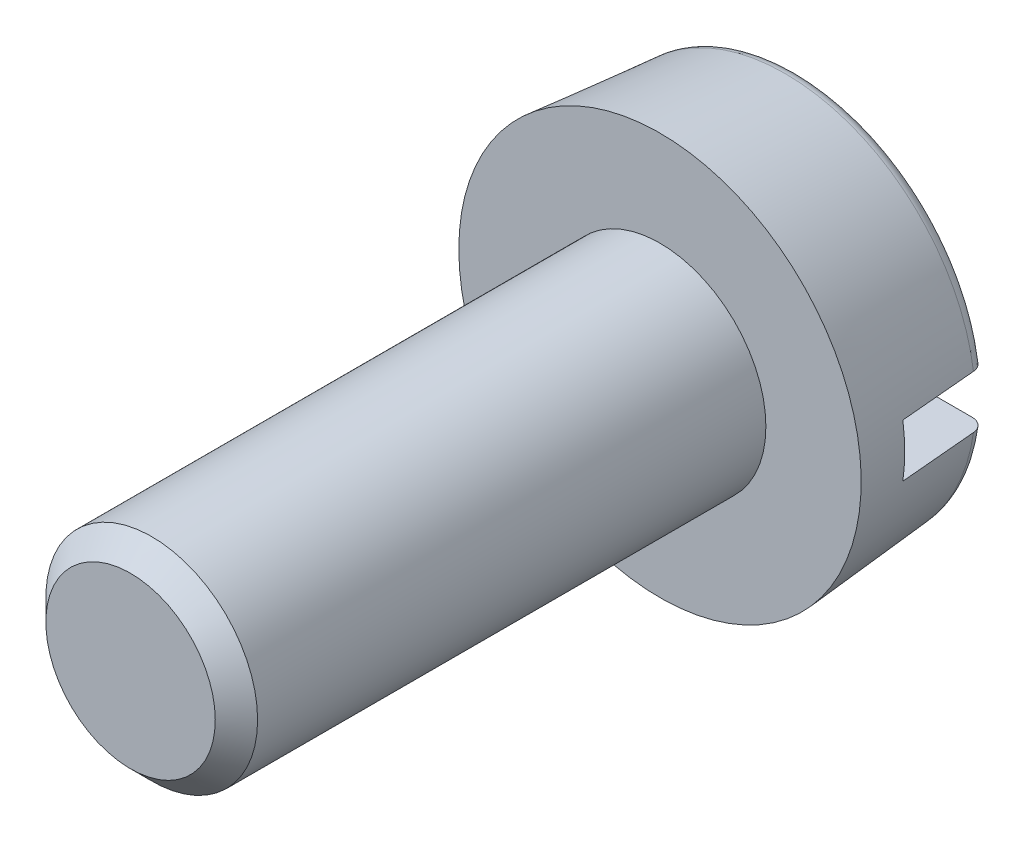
ISO-10303-21;
HEADER;
FILE_DESCRIPTION(('STEP AP214'),'2;1');
FILE_NAME('part.step','',(''),(''),'','','');
FILE_SCHEMA(('AUTOMOTIVE_DESIGN { 1 0 10303 214 1 1 1 1 }'));
ENDSEC;
DATA;
#1=APPLICATION_CONTEXT('core data for automotive mechanical design processes');
#2=APPLICATION_PROTOCOL_DEFINITION('international standard','automotive_design',2000,#1);
#3=PRODUCT_CONTEXT('',#1,'mechanical');
#4=PRODUCT('Part','Part','',(#3));
#5=PRODUCT_RELATED_PRODUCT_CATEGORY('part','',(#4));
#6=PRODUCT_DEFINITION_FORMATION('','',#4);
#7=PRODUCT_DEFINITION_CONTEXT('part definition',#1,'design');
#8=PRODUCT_DEFINITION('design','',#6,#7);
#9=PRODUCT_DEFINITION_SHAPE('','',#8);
#10=(LENGTH_UNIT() NAMED_UNIT(*) SI_UNIT(.MILLI.,.METRE.));
#11=(NAMED_UNIT(*) PLANE_ANGLE_UNIT() SI_UNIT($,.RADIAN.));
#12=(NAMED_UNIT(*) SI_UNIT($,.STERADIAN.) SOLID_ANGLE_UNIT());
#13=UNCERTAINTY_MEASURE_WITH_UNIT(LENGTH_MEASURE(1.E-05),#10,'distance_accuracy_value','');
#14=(GEOMETRIC_REPRESENTATION_CONTEXT(3) GLOBAL_UNCERTAINTY_ASSIGNED_CONTEXT((#13)) GLOBAL_UNIT_ASSIGNED_CONTEXT((#10,
#11,#12)) REPRESENTATION_CONTEXT('',''));
#15=CARTESIAN_POINT('',(0.,0.,0.));
#16=DIRECTION('',(0.,0.,1.));
#17=DIRECTION('',(1.,0.,0.));
#18=AXIS2_PLACEMENT_3D('',#15,#16,#17);
#19=CARTESIAN_POINT('',(0.,0.,-1.3));
#20=DIRECTION('',(0.,0.,1.));
#21=DIRECTION('',(1.,0.,0.));
#22=AXIS2_PLACEMENT_3D('',#19,#20,#21);
#23=PLANE('',#22);
#24=DIRECTION('',(1.,0.,0.));
#25=VECTOR('',#24,1.);
#26=CARTESIAN_POINT('',(-1.9,-0.25,-1.3));
#27=LINE('',#26,#25);
#28=CARTESIAN_POINT('',(-1.64829044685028,-0.25,-1.3));
#29=VERTEX_POINT('',#28);
#30=CARTESIAN_POINT('',(1.64829044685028,-0.25,-1.3));
#31=VERTEX_POINT('',#30);
#32=EDGE_CURVE('E176',#29,#31,#27,.T.);
#33=ORIENTED_EDGE('',*,*,#32,.T.);
#34=CARTESIAN_POINT('',(0.,0.,-1.3));
#35=DIRECTION('',(0.,0.,-1.));
#36=DIRECTION('',(-1.,0.,0.));
#37=AXIS2_PLACEMENT_3D('',#34,#35,#36);
#38=CIRCLE('',#37,1.66714168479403);
#39=EDGE_CURVE('E109',#31,#29,#38,.T.);
#40=ORIENTED_EDGE('',*,*,#39,.T.);
#41=EDGE_LOOP('',(#33,#40));
#42=FACE_BOUND('',#41,.T.);
#43=ADVANCED_FACE('F29',(#42),#23,.F.);
#44=DIRECTION('',(-1.,0.,0.));
#45=VECTOR('',#44,1.);
#46=CARTESIAN_POINT('',(-1.9,0.25,-1.3));
#47=LINE('',#46,#45);
#48=CARTESIAN_POINT('',(1.64829044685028,0.25,-1.3));
#49=VERTEX_POINT('',#48);
#50=CARTESIAN_POINT('',(-1.64829044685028,0.25,-1.3));
#51=VERTEX_POINT('',#50);
#52=EDGE_CURVE('E94',#49,#51,#47,.T.);
#53=ORIENTED_EDGE('',*,*,#52,.T.);
#54=EDGE_CURVE('E106',#51,#49,#38,.T.);
#55=ORIENTED_EDGE('',*,*,#54,.T.);
#56=EDGE_LOOP('',(#53,#55));
#57=FACE_BOUND('',#56,.T.);
#58=ADVANCED_FACE('F170',(#57),#23,.F.);
#59=CARTESIAN_POINT('',(0.,0.,-1.17));
#60=DIRECTION('',(0.,0.,-1.));
#61=DIRECTION('',(-1.,0.,0.));
#62=AXIS2_PLACEMENT_3D('',#59,#60,#61);
#63=TOROIDAL_SURFACE('',#62,1.66714168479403,0.13);
#64=CARTESIAN_POINT('',(-1.75207940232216,-0.25,-1.24972476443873));
#65=CARTESIAN_POINT('',(-1.75656295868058,-0.25,-1.24400743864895));
#66=CARTESIAN_POINT('',(-1.76056962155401,-0.25,-1.23790979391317));
#67=CARTESIAN_POINT('',(-1.76750704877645,-0.25,-1.22512420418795));
#68=CARTESIAN_POINT('',(-1.77043663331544,-0.25,-1.21843562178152));
#69=CARTESIAN_POINT('',(-1.77512829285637,-0.25,-1.20466142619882));
#70=CARTESIAN_POINT('',(-1.77689059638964,-0.25,-1.19757589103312));
#71=CARTESIAN_POINT('',(-1.77919471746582,-0.25,-1.18321083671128));
#72=CARTESIAN_POINT('',(-1.77973682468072,-0.25,-1.17593136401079));
#73=CARTESIAN_POINT('',(-1.77958551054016,-0.25,-1.16141340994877));
#74=CARTESIAN_POINT('',(-1.77889684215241,-0.25,-1.15417487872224));
#75=CARTESIAN_POINT('',(-1.7763137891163,-0.25,-1.13991614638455));
#76=CARTESIAN_POINT('',(-1.77441937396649,-0.25,-1.13289595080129));
#77=CARTESIAN_POINT('',(-1.76948140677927,-0.25,-1.11927276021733));
#78=CARTESIAN_POINT('',(-1.76643792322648,-0.25,-1.11266974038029));
#79=CARTESIAN_POINT('',(-1.75929153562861,-0.25,-1.10006454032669));
#80=CARTESIAN_POINT('',(-1.75518861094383,-0.25,-1.0940623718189));
#81=CARTESIAN_POINT('',(-1.74601676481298,-0.25,-1.08279196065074));
#82=CARTESIAN_POINT('',(-1.740942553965,-0.25,-1.07752802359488));
#83=CARTESIAN_POINT('',(-1.72998967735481,-0.25,-1.06791716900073));
#84=CARTESIAN_POINT('',(-1.72411097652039,-0.25,-1.06357029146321));
#85=CARTESIAN_POINT('',(-1.71165749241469,-0.25,-1.05587313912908));
#86=CARTESIAN_POINT('',(-1.70507670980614,-0.25,-1.05253257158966));
#87=CARTESIAN_POINT('',(-1.69145156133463,-0.25,-1.04699146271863));
#88=CARTESIAN_POINT('',(-1.68440716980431,-0.25,-1.04479098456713));
#89=CARTESIAN_POINT('',(-1.66998114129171,-0.25,-1.04157111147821));
#90=CARTESIAN_POINT('',(-1.6625968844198,-0.25,-1.04056344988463));
#91=CARTESIAN_POINT('',(-1.64776364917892,-0.25,-1.03979376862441));
#92=CARTESIAN_POINT('',(-1.64031466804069,-0.25,-1.04003180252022));
#93=CARTESIAN_POINT('',(-1.6255148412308,-0.25,-1.04175159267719));
#94=CARTESIAN_POINT('',(-1.61816488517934,-0.25,-1.04324101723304));
#95=CARTESIAN_POINT('',(-1.60381935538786,-0.25,-1.04743328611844));
#96=CARTESIAN_POINT('',(-1.59682378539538,-0.25,-1.05013614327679));
#97=CARTESIAN_POINT('',(-1.58339232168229,-0.25,-1.05668021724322));
#98=CARTESIAN_POINT('',(-1.57695606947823,-0.25,-1.06052069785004));
#99=CARTESIAN_POINT('',(-1.56482648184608,-0.25,-1.06923601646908));
#100=CARTESIAN_POINT('',(-1.55913311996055,-0.25,-1.07411081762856));
#101=CARTESIAN_POINT('',(-1.54870239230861,-0.25,-1.08471588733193));
#102=CARTESIAN_POINT('',(-1.54395763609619,-0.25,-1.09043888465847));
#103=CARTESIAN_POINT('',(-1.53551066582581,-0.25,-1.10260865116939));
#104=CARTESIAN_POINT('',(-1.53180837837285,-0.25,-1.10905536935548));
#105=CARTESIAN_POINT('',(-1.52560019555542,-0.25,-1.12240386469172));
#106=CARTESIAN_POINT('',(-1.52308002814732,-0.25,-1.12929900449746));
#107=CARTESIAN_POINT('',(-1.51924700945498,-0.25,-1.14341701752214));
#108=CARTESIAN_POINT('',(-1.51793407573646,-0.25,-1.15063986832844));
#109=CARTESIAN_POINT('',(-1.51656397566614,-0.25,-1.16512673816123));
#110=CARTESIAN_POINT('',(-1.51649373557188,-0.25,-1.17238952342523));
#111=CARTESIAN_POINT('',(-1.51757766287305,-0.25,-1.18682296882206));
#112=CARTESIAN_POINT('',(-1.51873179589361,-0.25,-1.19399363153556));
#113=CARTESIAN_POINT('',(-1.52222350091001,-0.25,-1.20801782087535));
#114=CARTESIAN_POINT('',(-1.52455754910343,-0.25,-1.21487222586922));
#115=CARTESIAN_POINT('',(-1.5303364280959,-0.25,-1.2280953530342));
#116=CARTESIAN_POINT('',(-1.53378128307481,-0.25,-1.23446406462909));
#117=CARTESIAN_POINT('',(-1.5417039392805,-0.25,-1.24657863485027));
#118=CARTESIAN_POINT('',(-1.54618795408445,-0.25,-1.25232042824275));
#119=CARTESIAN_POINT('',(-1.55604596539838,-0.25,-1.26298083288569));
#120=CARTESIAN_POINT('',(-1.56142001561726,-0.25,-1.26789939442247));
#121=CARTESIAN_POINT('',(-1.57297328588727,-0.25,-1.2768360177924));
#122=CARTESIAN_POINT('',(-1.57916128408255,-0.25,-1.28084273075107));
#123=CARTESIAN_POINT('',(-1.59211613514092,-0.25,-1.28777426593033));
#124=CARTESIAN_POINT('',(-1.5988830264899,-0.25,-1.29069901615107));
#125=CARTESIAN_POINT('',(-1.61288741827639,-0.25,-1.29541703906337));
#126=CARTESIAN_POINT('',(-1.62012943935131,-0.25,-1.29719689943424));
#127=CARTESIAN_POINT('',(-1.63480874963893,-0.25,-1.2995235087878));
#128=CARTESIAN_POINT('',(-1.64224603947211,-0.25,-1.30007025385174));
#129=CARTESIAN_POINT('',(-1.65715108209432,-0.25,-1.29991483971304));
#130=CARTESIAN_POINT('',(-1.66461876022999,-0.25,-1.29920539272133));
#131=CARTESIAN_POINT('',(-1.67933066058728,-0.25,-1.29654053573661));
#132=CARTESIAN_POINT('',(-1.68657482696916,-0.25,-1.29458481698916));
#133=CARTESIAN_POINT('',(-1.70062058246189,-0.25,-1.28948242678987));
#134=CARTESIAN_POINT('',(-1.7074226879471,-0.25,-1.28633717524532));
#135=CARTESIAN_POINT('',(-1.72039030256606,-0.25,-1.27894242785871));
#136=CARTESIAN_POINT('',(-1.72655658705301,-0.25,-1.2746942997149));
#137=CARTESIAN_POINT('',(-1.73596161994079,-0.25,-1.26695454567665));
#138=CARTESIAN_POINT('',(-1.73944542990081,-0.25,-1.26375570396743));
#139=CARTESIAN_POINT('',(-1.74604651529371,-0.25,-1.25699977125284));
#140=CARTESIAN_POINT('',(-1.74916379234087,-0.25,-1.25344268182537));
#141=CARTESIAN_POINT('',(-1.75207940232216,-0.25,-1.24972476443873));
#142=B_SPLINE_CURVE_WITH_KNOTS('',3,(#64,#65,#66,#67,#68,#69,#70,#71,#72,#73,#74,#75,#76,#77,
#78,#79,#80,#81,#82,#83,#84,#85,#86,#87,#88,#89,#90,#91,#92,#93,#94,#95,#96,#97,#98,#99,#100,
#101,#102,#103,#104,#105,#106,#107,#108,#109,#110,#111,#112,#113,#114,#115,#116,#117,#118,#119,
#120,#121,#122,#123,#124,#125,#126,#127,#128,#129,#130,#131,#132,#133,#134,#135,#136,#137,#138,
#139,#140,#141),.UNSPECIFIED.,.T.,.F.,(4,2,2,2,2,2,2,2,2,2,2,2,2,2,2,2,2,2,2,2,2,2,2,2,2,2,2,2,
2,2,2,2,2,2,2,2,2,2,4),(0.,0.0217799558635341,0.0435836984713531,0.0653831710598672,
0.0871774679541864,0.108887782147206,0.130598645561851,0.15230821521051,0.174018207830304,
0.195849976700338,0.217682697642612,0.239719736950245,0.26175799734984,0.284011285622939,
0.306265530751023,0.328657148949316,0.351049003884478,0.373426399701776,0.395802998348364,
0.417997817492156,0.440191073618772,0.462109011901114,0.484025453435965,0.505711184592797,
0.527396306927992,0.549017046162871,0.570638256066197,0.592392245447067,0.614147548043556,
0.636160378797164,0.658174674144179,0.680442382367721,0.70271016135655,0.725107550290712,
0.747510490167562,0.769886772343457,0.792235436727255,0.806398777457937,0.820562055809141),.UNSPECIFIED.);
#143=CARTESIAN_POINT('',(-1.77916846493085,-0.25,-1.1813302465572));
#144=VERTEX_POINT('',#143);
#145=EDGE_CURVE('E51',#29,#144,#142,.T.);
#146=ORIENTED_EDGE('',*,*,#145,.F.);
#147=ORIENTED_EDGE('',*,*,#39,.F.);
#148=CARTESIAN_POINT('',(1.53241969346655,-0.25,-1.23162912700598));
#149=CARTESIAN_POINT('',(1.52895812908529,-0.25,-1.22528322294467));
#150=CARTESIAN_POINT('',(1.52602672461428,-0.25,-1.21864252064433));
#151=CARTESIAN_POINT('',(1.52131693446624,-0.25,-1.20495835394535));
#152=CARTESIAN_POINT('',(1.51953978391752,-0.25,-1.19791446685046));
#153=CARTESIAN_POINT('',(1.51719662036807,-0.25,-1.18362880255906));
#154=CARTESIAN_POINT('',(1.51663035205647,-0.25,-1.17638706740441));
#155=CARTESIAN_POINT('',(1.51672626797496,-0.25,-1.16191354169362));
#156=CARTESIAN_POINT('',(1.51738817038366,-0.25,-1.15468174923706));
#157=CARTESIAN_POINT('',(1.51991534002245,-0.25,-1.14045434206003));
#158=CARTESIAN_POINT('',(1.52177696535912,-0.25,-1.13345807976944));
#159=CARTESIAN_POINT('',(1.52664338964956,-0.25,-1.1198751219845));
#160=CARTESIAN_POINT('',(1.52964824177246,-0.25,-1.11328844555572));
#161=CARTESIAN_POINT('',(1.53672679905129,-0.25,-1.10067887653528));
#162=CARTESIAN_POINT('',(1.54080516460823,-0.25,-1.09465860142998));
#163=CARTESIAN_POINT('',(1.54990432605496,-0.25,-1.08337850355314));
#164=CARTESIAN_POINT('',(1.554925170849,-0.25,-1.0781187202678));
#165=CARTESIAN_POINT('',(1.56582590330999,-0.25,-1.06844569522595));
#166=CARTESIAN_POINT('',(1.57171473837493,-0.25,-1.06404253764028));
#167=CARTESIAN_POINT('',(1.58414080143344,-0.25,-1.05627339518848));
#168=CARTESIAN_POINT('',(1.59067807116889,-0.25,-1.05290747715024));
#169=CARTESIAN_POINT('',(1.60430028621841,-0.25,-1.04726700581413));
#170=CARTESIAN_POINT('',(1.6113908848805,-0.25,-1.04500610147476));
#171=CARTESIAN_POINT('',(1.625849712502,-0.25,-1.04169697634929));
#172=CARTESIAN_POINT('',(1.63321795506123,-0.25,-1.04064881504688));
#173=CARTESIAN_POINT('',(1.64808070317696,-0.25,-1.03979053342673));
#174=CARTESIAN_POINT('',(1.65557573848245,-0.25,-1.03998955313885));
#175=CARTESIAN_POINT('',(1.67042618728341,-0.25,-1.04164307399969));
#176=CARTESIAN_POINT('',(1.67778159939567,-0.25,-1.04309758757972));
#177=CARTESIAN_POINT('',(1.6921417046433,-0.25,-1.04722406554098));
#178=CARTESIAN_POINT('',(1.69914644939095,-0.25,-1.04989585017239));
#179=CARTESIAN_POINT('',(1.7126035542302,-0.25,-1.05638531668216));
#180=CARTESIAN_POINT('',(1.71905593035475,-0.25,-1.06020296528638));
#181=CARTESIAN_POINT('',(1.73117715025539,-0.25,-1.0688497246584));
#182=CARTESIAN_POINT('',(1.73685100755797,-0.25,-1.07367180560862));
#183=CARTESIAN_POINT('',(1.74729844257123,-0.25,-1.08420877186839));
#184=CARTESIAN_POINT('',(1.752072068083,-0.25,-1.08992360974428));
#185=CARTESIAN_POINT('',(1.7605326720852,-0.25,-1.10202267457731));
#186=CARTESIAN_POINT('',(1.76423003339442,-0.25,-1.10839964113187));
#187=CARTESIAN_POINT('',(1.77049031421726,-0.25,-1.12168804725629));
#188=CARTESIAN_POINT('',(1.77305329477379,-0.25,-1.12859945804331));
#189=CARTESIAN_POINT('',(1.77694917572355,-0.25,-1.14269308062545));
#190=CARTESIAN_POINT('',(1.77829301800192,-0.25,-1.14987226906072));
#191=CARTESIAN_POINT('',(1.77974984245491,-0.25,-1.16435438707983));
#192=CARTESIAN_POINT('',(1.77986286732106,-0.25,-1.171657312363));
#193=CARTESIAN_POINT('',(1.77885718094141,-0.25,-1.1861421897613));
#194=CARTESIAN_POINT('',(1.77774441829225,-0.25,-1.19332455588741));
#195=CARTESIAN_POINT('',(1.77432995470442,-0.25,-1.20740073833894));
#196=CARTESIAN_POINT('',(1.772028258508,-0.25,-1.21429455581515));
#197=CARTESIAN_POINT('',(1.76630135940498,-0.25,-1.22760648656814));
#198=CARTESIAN_POINT('',(1.76287503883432,-0.25,-1.2340241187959));
#199=CARTESIAN_POINT('',(1.75500016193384,-0.25,-1.24619791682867));
#200=CARTESIAN_POINT('',(1.75055157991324,-0.25,-1.25195406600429));
#201=CARTESIAN_POINT('',(1.74072913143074,-0.25,-1.26268237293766));
#202=CARTESIAN_POINT('',(1.73534948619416,-0.25,-1.26764923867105));
#203=CARTESIAN_POINT('',(1.72383961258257,-0.25,-1.2766197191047));
#204=CARTESIAN_POINT('',(1.71770934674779,-0.25,-1.28062328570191));
#205=CARTESIAN_POINT('',(1.7048088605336,-0.25,-1.28759504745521));
#206=CARTESIAN_POINT('',(1.69803301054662,-0.25,-1.29055282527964));
#207=CARTESIAN_POINT('',(1.684083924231,-0.25,-1.29530087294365));
#208=CARTESIAN_POINT('',(1.67691066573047,-0.25,-1.29709107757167));
#209=CARTESIAN_POINT('',(1.66229791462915,-0.25,-1.29946931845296));
#210=CARTESIAN_POINT('',(1.65485654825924,-0.25,-1.30004584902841));
#211=CARTESIAN_POINT('',(1.63998216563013,-0.25,-1.29994844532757));
#212=CARTESIAN_POINT('',(1.63254914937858,-0.25,-1.29927450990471));
#213=CARTESIAN_POINT('',(1.61786269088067,-0.25,-1.29668841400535));
#214=CARTESIAN_POINT('',(1.61061034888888,-0.25,-1.29476999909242));
#215=CARTESIAN_POINT('',(1.59652954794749,-0.25,-1.28973991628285));
#216=CARTESIAN_POINT('',(1.58970119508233,-0.25,-1.28662795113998));
#217=CARTESIAN_POINT('',(1.57667829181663,-0.25,-1.27930148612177));
#218=CARTESIAN_POINT('',(1.57048279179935,-0.25,-1.27508867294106));
#219=CARTESIAN_POINT('',(1.55890129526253,-0.25,-1.2656764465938));
#220=CARTESIAN_POINT('',(1.55351430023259,-0.25,-1.26047826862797));
#221=CARTESIAN_POINT('',(1.54550147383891,-0.25,-1.25129950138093));
#222=CARTESIAN_POINT('',(1.54258582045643,-0.25,-1.24756772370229));
#223=CARTESIAN_POINT('',(1.5371776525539,-0.25,-1.23980909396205));
#224=CARTESIAN_POINT('',(1.53468513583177,-0.25,-1.23578224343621));
#225=CARTESIAN_POINT('',(1.53241969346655,-0.25,-1.23162912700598));
#226=B_SPLINE_CURVE_WITH_KNOTS('',3,(#148,#149,#150,#151,#152,#153,#154,#155,#156,#157,#158,
#159,#160,#161,#162,#163,#164,#165,#166,#167,#168,#169,#170,#171,#172,#173,#174,#175,#176,#177,
#178,#179,#180,#181,#182,#183,#184,#185,#186,#187,#188,#189,#190,#191,#192,#193,#194,#195,#196,
#197,#198,#199,#200,#201,#202,#203,#204,#205,#206,#207,#208,#209,#210,#211,#212,#213,#214,#215,
#216,#217,#218,#219,#220,#221,#222,#223,#224,#225),.UNSPECIFIED.,.T.,.F.,(4,2,2,2,2,2,2,2,2,2,2,
2,2,2,2,2,2,2,2,2,2,2,2,2,2,2,2,2,2,2,2,2,2,2,2,2,2,2,4),(0.,0.0216687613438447,
0.0433606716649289,0.0650480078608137,0.0867303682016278,0.10834721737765,0.129965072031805,
0.151678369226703,0.173392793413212,0.195349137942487,0.217306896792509,0.239529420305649,
0.261753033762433,0.284139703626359,0.30652659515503,0.32891018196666,0.351293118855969,
0.373524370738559,0.395754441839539,0.417762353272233,0.439769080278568,0.461576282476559,
0.483382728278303,0.505083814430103,0.526784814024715,0.548507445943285,0.570230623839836,
0.592093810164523,0.613958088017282,0.636034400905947,0.658111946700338,0.680397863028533,
0.702683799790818,0.725082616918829,0.747487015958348,0.769857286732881,0.79219969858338,
0.806381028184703,0.820562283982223),.UNSPECIFIED.);
#227=CARTESIAN_POINT('',(1.77916846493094,-0.25,-1.18133024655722));
#228=VERTEX_POINT('',#227);
#229=EDGE_CURVE('E126',#228,#31,#226,.T.);
#230=ORIENTED_EDGE('',*,*,#229,.F.);
#231=CARTESIAN_POINT('',(0.,0.,-1.1813302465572));
#232=DIRECTION('',(0.,0.,-1.));
#233=DIRECTION('',(-1.,0.,0.));
#234=AXIS2_PLACEMENT_3D('',#231,#232,#233);
#235=CIRCLE('',#234,1.79664699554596);
#236=EDGE_CURVE('E118',#228,#144,#235,.T.);
#237=ORIENTED_EDGE('',*,*,#236,.T.);
#238=EDGE_LOOP('',(#146,#147,#230,#237));
#239=FACE_BOUND('',#238,.T.);
#240=ADVANCED_FACE('F130',(#239),#63,.T.);
#241=CARTESIAN_POINT('',(-1.75207940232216,0.25,-1.24972476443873));
#242=CARTESIAN_POINT('',(-1.74753384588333,0.25,-1.25552008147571));
#243=CARTESIAN_POINT('',(-1.74249152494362,0.25,-1.26093301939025));
#244=CARTESIAN_POINT('',(-1.73156319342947,0.25,-1.27083741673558));
#245=CARTESIAN_POINT('',(-1.72567607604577,0.25,-1.27532764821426));
#246=CARTESIAN_POINT('',(-1.71323808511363,0.25,-1.28325494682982));
#247=CARTESIAN_POINT('',(-1.70668781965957,0.25,-1.28669296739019));
#248=CARTESIAN_POINT('',(-1.69310817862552,0.25,-1.29242853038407));
#249=CARTESIAN_POINT('',(-1.68607892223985,0.25,-1.29472635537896));
#250=CARTESIAN_POINT('',(-1.67168398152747,0.25,-1.29813613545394));
#251=CARTESIAN_POINT('',(-1.66431621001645,0.25,-1.29923928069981));
#252=CARTESIAN_POINT('',(-1.64949946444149,0.25,-1.30020167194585));
#253=CARTESIAN_POINT('',(-1.64205048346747,0.25,-1.3000608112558));
#254=CARTESIAN_POINT('',(-1.62723283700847,0.25,-1.29853489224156));
#255=CARTESIAN_POINT('',(-1.61986498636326,0.25,-1.29714190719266));
#256=CARTESIAN_POINT('',(-1.60546759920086,0.25,-1.29313852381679));
#257=CARTESIAN_POINT('',(-1.59843806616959,0.25,-1.2905281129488));
#258=CARTESIAN_POINT('',(-1.58492127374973,0.25,-1.28416137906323));
#259=CARTESIAN_POINT('',(-1.57843382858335,0.25,-1.28040545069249));
#260=CARTESIAN_POINT('',(-1.56618806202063,0.25,-1.27184963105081));
#261=CARTESIAN_POINT('',(-1.56042971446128,0.25,-1.267049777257));
#262=CARTESIAN_POINT('',(-1.54985607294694,0.25,-1.25658080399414));
#263=CARTESIAN_POINT('',(-1.54503371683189,0.25,-1.25091881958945));
#264=CARTESIAN_POINT('',(-1.53642220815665,0.25,-1.23885702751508));
#265=CARTESIAN_POINT('',(-1.53263298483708,0.25,-1.23245727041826));
#266=CARTESIAN_POINT('',(-1.52624509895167,0.25,-1.21918622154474));
#267=CARTESIAN_POINT('',(-1.52363231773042,0.25,-1.21232172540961));
#268=CARTESIAN_POINT('',(-1.51961046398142,0.25,-1.19824877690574));
#269=CARTESIAN_POINT('',(-1.51820130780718,0.25,-1.19104034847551));
#270=CARTESIAN_POINT('',(-1.51663936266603,0.25,-1.17656707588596));
#271=CARTESIAN_POINT('',(-1.51647326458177,0.25,-1.16930366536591));
#272=CARTESIAN_POINT('',(-1.51736741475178,0.25,-1.15485289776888));
#273=CARTESIAN_POINT('',(-1.51842762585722,0.25,-1.14766553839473));
#274=CARTESIAN_POINT('',(-1.52173595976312,0.25,-1.13359521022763));
#275=CARTESIAN_POINT('',(-1.52398011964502,0.25,-1.1267113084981));
#276=CARTESIAN_POINT('',(-1.52958577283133,0.25,-1.11341479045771));
#277=CARTESIAN_POINT('',(-1.53294728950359,0.25,-1.10700218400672));
#278=CARTESIAN_POINT('',(-1.54071039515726,0.25,-1.09478854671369));
#279=CARTESIAN_POINT('',(-1.54511792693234,0.25,-1.08899129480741));
#280=CARTESIAN_POINT('',(-1.55483332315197,0.25,-1.07820818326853));
#281=CARTESIAN_POINT('',(-1.56014123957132,0.25,-1.07322237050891));
#282=CARTESIAN_POINT('',(-1.57157292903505,0.25,-1.064141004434));
#283=CARTESIAN_POINT('',(-1.57770553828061,0.25,-1.06005657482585));
#284=CARTESIAN_POINT('',(-1.59056318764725,0.25,-1.05296136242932));
#285=CARTESIAN_POINT('',(-1.59728826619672,0.25,-1.04995064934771));
#286=CARTESIAN_POINT('',(-1.61122407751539,0.25,-1.04505337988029));
#287=CARTESIAN_POINT('',(-1.61843954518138,0.25,-1.04318029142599));
#288=CARTESIAN_POINT('',(-1.63308191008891,0.25,-1.04066365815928));
#289=CARTESIAN_POINT('',(-1.64050881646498,0.25,-1.04002016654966));
#290=CARTESIAN_POINT('',(-1.6554122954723,0.25,-1.03998064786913));
#291=CARTESIAN_POINT('',(-1.66288889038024,0.25,-1.04059238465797));
#292=CARTESIAN_POINT('',(-1.6776330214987,0.25,-1.04306400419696));
#293=CARTESIAN_POINT('',(-1.68490055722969,0.25,-1.0449238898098));
#294=CARTESIAN_POINT('',(-1.69900829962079,0.25,-1.04983951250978));
#295=CARTESIAN_POINT('',(-1.7058490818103,0.25,-1.05289359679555));
#296=CARTESIAN_POINT('',(-1.71891537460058,0.25,-1.0601153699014));
#297=CARTESIAN_POINT('',(-1.72514090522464,0.25,-1.06428302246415));
#298=CARTESIAN_POINT('',(-1.73674840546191,0.25,-1.07358109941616));
#299=CARTESIAN_POINT('',(-1.74213641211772,0.25,-1.07870398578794));
#300=CARTESIAN_POINT('',(-1.75196509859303,0.25,-1.08978982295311));
#301=CARTESIAN_POINT('',(-1.7564058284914,0.25,-1.09575272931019));
#302=CARTESIAN_POINT('',(-1.76416637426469,0.25,-1.10828464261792));
#303=CARTESIAN_POINT('',(-1.76749705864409,0.25,-1.11484691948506));
#304=CARTESIAN_POINT('',(-1.77299835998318,0.25,-1.12844064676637));
#305=CARTESIAN_POINT('',(-1.77516908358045,0.25,-1.13547205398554));
#306=CARTESIAN_POINT('',(-1.77827125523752,0.25,-1.1497390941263));
#307=CARTESIAN_POINT('',(-1.77921328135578,0.25,-1.1569724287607));
#308=CARTESIAN_POINT('',(-1.77986439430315,0.25,-1.17149630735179));
#309=CARTESIAN_POINT('',(-1.77957320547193,0.25,-1.17878686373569));
#310=CARTESIAN_POINT('',(-1.77776969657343,0.25,-1.19318884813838));
#311=CARTESIAN_POINT('',(-1.77626159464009,0.25,-1.20030080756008));
#312=CARTESIAN_POINT('',(-1.77207528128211,0.25,-1.21416491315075));
#313=CARTESIAN_POINT('',(-1.76939850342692,0.25,-1.22091748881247));
#314=CARTESIAN_POINT('',(-1.76421733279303,0.25,-1.23134452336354));
#315=CARTESIAN_POINT('',(-1.7620532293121,0.25,-1.23519194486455));
#316=CARTESIAN_POINT('',(-1.75734526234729,0.25,-1.24264687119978));
#317=CARTESIAN_POINT('',(-1.75480140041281,0.25,-1.24625437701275));
#318=CARTESIAN_POINT('',(-1.75207940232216,0.25,-1.24972476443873));
#319=B_SPLINE_CURVE_WITH_KNOTS('',3,(#241,#242,#243,#244,#245,#246,#247,#248,#249,#250,#251,
#252,#253,#254,#255,#256,#257,#258,#259,#260,#261,#262,#263,#264,#265,#266,#267,#268,#269,#270,
#271,#272,#273,#274,#275,#276,#277,#278,#279,#280,#281,#282,#283,#284,#285,#286,#287,#288,#289,
#290,#291,#292,#293,#294,#295,#296,#297,#298,#299,#300,#301,#302,#303,#304,#305,#306,#307,#308,
#309,#310,#311,#312,#313,#314,#315,#316,#317,#318),.UNSPECIFIED.,.T.,.F.,(4,2,2,2,2,2,2,2,2,2,2,
2,2,2,2,2,2,2,2,2,2,2,2,2,2,2,2,2,2,2,2,2,2,2,2,2,2,2,4),(0.,0.0220796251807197,
0.0441884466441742,0.0662771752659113,0.0883604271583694,0.110605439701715,0.132852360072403,
0.155241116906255,0.177630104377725,0.200011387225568,0.222391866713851,0.244596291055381,
0.266799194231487,0.288728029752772,0.310655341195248,0.33234754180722,0.354039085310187,
0.375658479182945,0.397278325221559,0.419024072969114,0.44077107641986,0.462773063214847,
0.484776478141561,0.507035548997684,0.529295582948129,0.551693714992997,0.574091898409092,
0.59645919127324,0.61882575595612,0.641022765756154,0.663218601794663,0.685190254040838,
0.707159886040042,0.728939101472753,0.750723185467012,0.772432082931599,0.79411442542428,
0.807336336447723,0.820558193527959),.UNSPECIFIED.);
#320=CARTESIAN_POINT('',(-1.77916846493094,0.25,-1.18133024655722));
#321=VERTEX_POINT('',#320);
#322=EDGE_CURVE('E182',#321,#51,#319,.T.);
#323=ORIENTED_EDGE('',*,*,#322,.F.);
#324=CARTESIAN_POINT('',(1.77916846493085,0.25,-1.1813302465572));
#325=VERTEX_POINT('',#324);
#326=EDGE_CURVE('E114',#321,#325,#235,.T.);
#327=ORIENTED_EDGE('',*,*,#326,.T.);
#328=CARTESIAN_POINT('',(1.53241969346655,0.25,-1.23162912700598));
#329=CARTESIAN_POINT('',(1.53593742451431,0.25,-1.23807661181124));
#330=CARTESIAN_POINT('',(1.54000770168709,0.25,-1.24422917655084));
#331=CARTESIAN_POINT('',(1.54913013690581,0.25,-1.2557660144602));
#332=CARTESIAN_POINT('',(1.55418361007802,0.25,-1.26114924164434));
#333=CARTESIAN_POINT('',(1.56511527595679,0.25,-1.27098882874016));
#334=CARTESIAN_POINT('',(1.57099263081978,0.25,-1.27544611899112));
#335=CARTESIAN_POINT('',(1.58340481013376,0.25,-1.28331967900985));
#336=CARTESIAN_POINT('',(1.58993947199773,0.25,-1.28673620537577));
#337=CARTESIAN_POINT('',(1.60354504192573,0.25,-1.29246598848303));
#338=CARTESIAN_POINT('',(1.610620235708,0.25,-1.29476907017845));
#339=CARTESIAN_POINT('',(1.62505577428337,0.25,-1.29816480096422));
#340=CARTESIAN_POINT('',(1.63241614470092,0.25,-1.29925734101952));
#341=CARTESIAN_POINT('',(1.64727150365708,0.25,-1.30020570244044));
#342=CARTESIAN_POINT('',(1.65476708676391,0.25,-1.30005224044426));
#343=CARTESIAN_POINT('',(1.66962629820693,0.25,-1.29848927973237));
#344=CARTESIAN_POINT('',(1.6769899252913,0.25,-1.2970797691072));
#345=CARTESIAN_POINT('',(1.69137501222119,0.25,-1.29304122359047));
#346=CARTESIAN_POINT('',(1.69839647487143,0.25,-1.29041219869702));
#347=CARTESIAN_POINT('',(1.71189405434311,0.25,-1.28400492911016));
#348=CARTESIAN_POINT('',(1.71837018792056,0.25,-1.28022671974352));
#349=CARTESIAN_POINT('',(1.73054577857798,0.25,-1.27165368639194));
#350=CARTESIAN_POINT('',(1.73625013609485,0.25,-1.26686582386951));
#351=CARTESIAN_POINT('',(1.74676396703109,0.25,-1.25639163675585));
#352=CARTESIAN_POINT('',(1.75157348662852,0.25,-1.25070535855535));
#353=CARTESIAN_POINT('',(1.76010993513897,0.25,-1.23865649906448));
#354=CARTESIAN_POINT('',(1.76384718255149,0.25,-1.23230122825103));
#355=CARTESIAN_POINT('',(1.77019027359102,0.25,-1.21904911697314));
#356=CARTESIAN_POINT('',(1.77279617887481,0.25,-1.2121523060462));
#357=CARTESIAN_POINT('',(1.77677914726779,0.25,-1.19808060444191));
#358=CARTESIAN_POINT('',(1.77816719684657,0.25,-1.19090882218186));
#359=CARTESIAN_POINT('',(1.7797129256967,0.25,-1.17643394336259));
#360=CARTESIAN_POINT('',(1.77987064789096,0.25,-1.16913085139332));
#361=CARTESIAN_POINT('',(1.77895332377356,0.25,-1.15463884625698));
#362=CARTESIAN_POINT('',(1.77788434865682,0.25,-1.14744954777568));
#363=CARTESIAN_POINT('',(1.77455554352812,0.25,-1.13335230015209));
#364=CARTESIAN_POINT('',(1.77229571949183,0.25,-1.12644434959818));
#365=CARTESIAN_POINT('',(1.76664978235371,0.25,-1.11309814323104));
#366=CARTESIAN_POINT('',(1.76326267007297,0.25,-1.10666031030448));
#367=CARTESIAN_POINT('',(1.7554622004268,0.25,-1.09443991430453));
#368=CARTESIAN_POINT('',(1.75104881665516,0.25,-1.08865736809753));
#369=CARTESIAN_POINT('',(1.74129241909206,0.25,-1.0778711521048));
#370=CARTESIAN_POINT('',(1.73594366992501,0.25,-1.07287267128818));
#371=CARTESIAN_POINT('',(1.72448989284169,0.25,-1.06383431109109));
#372=CARTESIAN_POINT('',(1.7183848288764,0.25,-1.05979447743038));
#373=CARTESIAN_POINT('',(1.70552879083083,0.25,-1.05274626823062));
#374=CARTESIAN_POINT('',(1.69877214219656,0.25,-1.04974824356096));
#375=CARTESIAN_POINT('',(1.68485452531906,0.25,-1.04491702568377));
#376=CARTESIAN_POINT('',(1.67769353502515,0.25,-1.04308389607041));
#377=CARTESIAN_POINT('',(1.66309796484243,0.25,-1.04061781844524));
#378=CARTESIAN_POINT('',(1.65566143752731,0.25,-1.03999638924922));
#379=CARTESIAN_POINT('',(1.64078888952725,0.25,-1.04000364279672));
#380=CARTESIAN_POINT('',(1.63335286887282,0.25,-1.04063237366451));
#381=CARTESIAN_POINT('',(1.61865121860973,0.25,-1.04312908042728));
#382=CARTESIAN_POINT('',(1.61138669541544,0.25,-1.04500357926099));
#383=CARTESIAN_POINT('',(1.59727614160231,0.25,-1.04994768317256));
#384=CARTESIAN_POINT('',(1.59043011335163,0.25,-1.05301729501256));
#385=CARTESIAN_POINT('',(1.57736655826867,0.25,-1.06026175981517));
#386=CARTESIAN_POINT('',(1.57114788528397,0.25,-1.06443454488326));
#387=CARTESIAN_POINT('',(1.55950751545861,0.25,-1.07377383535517));
#388=CARTESIAN_POINT('',(1.55408578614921,0.25,-1.0789403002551));
#389=CARTESIAN_POINT('',(1.54424770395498,0.25,-1.09007156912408));
#390=CARTESIAN_POINT('',(1.53982266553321,0.25,-1.09602869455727));
#391=CARTESIAN_POINT('',(1.53205071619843,0.25,-1.10860878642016));
#392=CARTESIAN_POINT('',(1.52870368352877,0.25,-1.11523167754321));
#393=CARTESIAN_POINT('',(1.52322682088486,0.25,-1.12886542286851));
#394=CARTESIAN_POINT('',(1.52108211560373,0.25,-1.13587030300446));
#395=CARTESIAN_POINT('',(1.51801160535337,0.25,-1.15014428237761));
#396=CARTESIAN_POINT('',(1.51708603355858,0.25,-1.15741343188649));
#397=CARTESIAN_POINT('',(1.51648615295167,0.25,-1.1719354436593));
#398=CARTESIAN_POINT('',(1.51680045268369,0.25,-1.17918784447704));
#399=CARTESIAN_POINT('',(1.51864518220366,0.25,-1.19352990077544));
#400=CARTESIAN_POINT('',(1.52017408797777,0.25,-1.20061974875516));
#401=CARTESIAN_POINT('',(1.52355968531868,0.25,-1.21170246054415));
#402=CARTESIAN_POINT('',(1.52504786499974,0.25,-1.21581164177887));
#403=CARTESIAN_POINT('',(1.52843215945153,0.25,-1.22385833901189));
#404=CARTESIAN_POINT('',(1.530328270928,0.25,-1.22779585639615));
#405=CARTESIAN_POINT('',(1.53241969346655,0.25,-1.23162912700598));
#406=B_SPLINE_CURVE_WITH_KNOTS('',3,(#328,#329,#330,#331,#332,#333,#334,#335,#336,#337,#338,
#339,#340,#341,#342,#343,#344,#345,#346,#347,#348,#349,#350,#351,#352,#353,#354,#355,#356,#357,
#358,#359,#360,#361,#362,#363,#364,#365,#366,#367,#368,#369,#370,#371,#372,#373,#374,#375,#376,
#377,#378,#379,#380,#381,#382,#383,#384,#385,#386,#387,#388,#389,#390,#391,#392,#393,#394,#395,
#396,#397,#398,#399,#400,#401,#402,#403,#404,#405),.UNSPECIFIED.,.T.,.F.,(4,2,2,2,2,2,2,2,2,2,2,
2,2,2,2,2,2,2,2,2,2,2,2,2,2,2,2,2,2,2,2,2,2,2,2,2,2,2,4),(0.,0.0220178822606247,
0.044065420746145,0.0660906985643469,0.0881105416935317,0.110327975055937,0.132547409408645,
0.154932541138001,0.177317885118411,0.199703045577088,0.222087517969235,0.244322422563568,
0.266556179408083,0.288568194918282,0.310579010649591,0.33238915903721,0.354198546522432,
0.375900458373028,0.397602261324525,0.419323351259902,0.441045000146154,0.462904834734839,
0.484765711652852,0.506837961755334,0.528911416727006,0.551193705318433,0.573476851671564,
0.59587760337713,0.618278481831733,0.6406376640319,0.662995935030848,0.685151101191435,
0.70730376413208,0.729175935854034,0.751052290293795,0.772728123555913,0.794376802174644,
0.807467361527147,0.820557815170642),.UNSPECIFIED.);
#407=EDGE_CURVE('E183',#49,#325,#406,.T.);
#408=ORIENTED_EDGE('',*,*,#407,.F.);
#409=ORIENTED_EDGE('',*,*,#54,.F.);
#410=EDGE_LOOP('',(#323,#327,#408,#409));
#411=FACE_BOUND('',#410,.T.);
#412=ADVANCED_FACE('F155',(#411),#63,.T.);
#413=CARTESIAN_POINT('',(0.,0.,0.));
#414=DIRECTION('',(0.,0.,1.));
#415=DIRECTION('',(1.,0.,0.));
#416=AXIS2_PLACEMENT_3D('',#413,#414,#415);
#417=CONICAL_SURFACE('',#416,1.9,0.087266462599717);
#418=CARTESIAN_POINT('',(0.,0.,0.));
#419=DIRECTION('',(0.,0.,-1.));
#420=DIRECTION('',(-1.,0.,0.));
#421=AXIS2_PLACEMENT_3D('',#418,#419,#420);
#422=CIRCLE('',#421,1.9);
#423=CARTESIAN_POINT('',(-1.9,0.,0.));
#424=VERTEX_POINT('',#423);
#425=EDGE_CURVE('E119',#424,#424,#422,.T.);
#426=ORIENTED_EDGE('',*,*,#425,.T.);
#427=EDGE_LOOP('',(#426));
#428=FACE_BOUND('',#427,.T.);
#429=CARTESIAN_POINT('',(-1.51244086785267,-0.25,-4.1952453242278));
#430=CARTESIAN_POINT('',(-1.59546718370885,-0.25,-3.25887360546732));
#431=CARTESIAN_POINT('',(-1.67833042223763,-0.25,-2.3224874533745));
#432=CARTESIAN_POINT('',(-1.77687550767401,-0.25,-1.20730052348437));
#433=CARTESIAN_POINT('',(-1.792670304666,-0.25,-1.02850972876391));
#434=CARTESIAN_POINT('',(-1.90695491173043,-0.25,0.265472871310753));
#435=CARTESIAN_POINT('',(-2.00529483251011,-0.25,1.38067791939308));
#436=CARTESIAN_POINT('',(-2.10355836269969,-0.25,2.49588968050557));
#437=B_SPLINE_CURVE_WITH_KNOTS('',3,(#429,#430,#431,#432,#433,#434,#435,#436),.UNSPECIFIED.,.F.,
.F.,(4,2,2,4),(0.,2.82013616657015,3.35859750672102,6.71719498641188),.UNSPECIFIED.);
#438=CARTESIAN_POINT('',(-1.84375822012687,-0.25,-0.45));
#439=VERTEX_POINT('',#438);
#440=EDGE_CURVE('E79',#144,#439,#437,.T.);
#441=ORIENTED_EDGE('',*,*,#440,.F.);
#442=ORIENTED_EDGE('',*,*,#236,.F.);
#443=CARTESIAN_POINT('',(2.10355836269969,-0.25,2.49588968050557));
#444=CARTESIAN_POINT('',(2.05443022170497,-0.25,1.93828347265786));
#445=CARTESIAN_POINT('',(2.00527948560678,-0.25,1.38067925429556));
#446=CARTESIAN_POINT('',(1.90691851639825,-0.25,0.265476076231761));
#447=CARTESIAN_POINT('',(1.85770828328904,-0.25,-0.292122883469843));
#448=CARTESIAN_POINT('',(1.75921401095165,-0.25,-1.40731429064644));
#449=CARTESIAN_POINT('',(1.70992997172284,-0.25,-1.96490673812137));
#450=CARTESIAN_POINT('',(1.61126443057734,-0.25,-3.08008302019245));
#451=CARTESIAN_POINT('',(1.56188292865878,-0.25,-3.63766685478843));
#452=CARTESIAN_POINT('',(1.51244086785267,-0.25,-4.1952453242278));
#453=B_SPLINE_CURVE_WITH_KNOTS('',3,(#443,#444,#445,#446,#447,#448,#449,#450,#451,#452),
.UNSPECIFIED.,.F.,.F.,(4,2,2,2,4),(0.,1.67929875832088,3.35859748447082,5.03789622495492,
6.71719499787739),.UNSPECIFIED.);
#454=CARTESIAN_POINT('',(1.84375822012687,-0.25,-0.45));
#455=VERTEX_POINT('',#454);
#456=EDGE_CURVE('E99',#455,#228,#453,.T.);
#457=ORIENTED_EDGE('',*,*,#456,.F.);
#458=CARTESIAN_POINT('',(0.,0.,-0.45));
#459=DIRECTION('',(0.,0.,1.));
#460=DIRECTION('',(1.,0.,0.));
#461=AXIS2_PLACEMENT_3D('',#458,#459,#460);
#462=CIRCLE('',#461,1.86063010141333);
#463=CARTESIAN_POINT('',(1.84375822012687,0.25,-0.45));
#464=VERTEX_POINT('',#463);
#465=EDGE_CURVE('E93',#455,#464,#462,.T.);
#466=ORIENTED_EDGE('',*,*,#465,.T.);
#467=CARTESIAN_POINT('',(1.51244086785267,0.25,-4.1952453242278));
#468=CARTESIAN_POINT('',(1.59546718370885,0.25,-3.25887360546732));
#469=CARTESIAN_POINT('',(1.67833042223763,0.25,-2.3224874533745));
#470=CARTESIAN_POINT('',(1.77687550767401,0.25,-1.20730052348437));
#471=CARTESIAN_POINT('',(1.792670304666,0.25,-1.02850972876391));
#472=CARTESIAN_POINT('',(1.90695491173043,0.25,0.265472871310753));
#473=CARTESIAN_POINT('',(2.00529483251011,0.25,1.38067791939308));
#474=CARTESIAN_POINT('',(2.10355836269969,0.25,2.49588968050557));
#475=B_SPLINE_CURVE_WITH_KNOTS('',3,(#467,#468,#469,#470,#471,#472,#473,#474),.UNSPECIFIED.,.F.,
.F.,(4,2,2,4),(0.,2.82013616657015,3.35859750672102,6.71719498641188),.UNSPECIFIED.);
#476=EDGE_CURVE('E102',#325,#464,#475,.T.);
#477=ORIENTED_EDGE('',*,*,#476,.F.);
#478=ORIENTED_EDGE('',*,*,#326,.F.);
#479=CARTESIAN_POINT('',(-2.10355836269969,0.25,2.49588968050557));
#480=CARTESIAN_POINT('',(-2.05443022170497,0.25,1.93828347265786));
#481=CARTESIAN_POINT('',(-2.00527948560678,0.25,1.38067925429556));
#482=CARTESIAN_POINT('',(-1.90691851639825,0.25,0.265476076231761));
#483=CARTESIAN_POINT('',(-1.85770828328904,0.25,-0.292122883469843));
#484=CARTESIAN_POINT('',(-1.75921401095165,0.25,-1.40731429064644));
#485=CARTESIAN_POINT('',(-1.70992997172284,0.25,-1.96490673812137));
#486=CARTESIAN_POINT('',(-1.61126443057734,0.25,-3.08008302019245));
#487=CARTESIAN_POINT('',(-1.56188292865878,0.25,-3.63766685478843));
#488=CARTESIAN_POINT('',(-1.51244086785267,0.25,-4.1952453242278));
#489=B_SPLINE_CURVE_WITH_KNOTS('',3,(#479,#480,#481,#482,#483,#484,#485,#486,#487,#488),
.UNSPECIFIED.,.F.,.F.,(4,2,2,2,4),(0.,1.67929875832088,3.35859748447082,5.03789622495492,
6.71719499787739),.UNSPECIFIED.);
#490=CARTESIAN_POINT('',(-1.84375822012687,0.25,-0.45));
#491=VERTEX_POINT('',#490);
#492=EDGE_CURVE('E88',#491,#321,#489,.T.);
#493=ORIENTED_EDGE('',*,*,#492,.F.);
#494=EDGE_CURVE('E91',#491,#439,#462,.T.);
#495=ORIENTED_EDGE('',*,*,#494,.T.);
#496=EDGE_LOOP('',(#441,#442,#457,#466,#477,#478,#493,#495));
#497=FACE_BOUND('',#496,.T.);
#498=ADVANCED_FACE('F97',(#428,#497),#417,.T.);
#499=CARTESIAN_POINT('',(0.,0.,0.));
#500=DIRECTION('',(0.,0.,-1.));
#501=DIRECTION('',(-1.,0.,0.));
#502=AXIS2_PLACEMENT_3D('',#499,#500,#501);
#503=PLANE('',#502);
#504=CARTESIAN_POINT('',(0.,0.,0.));
#505=DIRECTION('',(0.,0.,1.));
#506=DIRECTION('',(1.,0.,0.));
#507=AXIS2_PLACEMENT_3D('',#504,#505,#506);
#508=CIRCLE('',#507,1.);
#509=CARTESIAN_POINT('',(1.,0.,0.));
#510=VERTEX_POINT('',#509);
#511=EDGE_CURVE('E178',#510,#510,#508,.T.);
#512=ORIENTED_EDGE('',*,*,#511,.F.);
#513=EDGE_LOOP('',(#512));
#514=FACE_BOUND('',#513,.T.);
#515=ORIENTED_EDGE('',*,*,#425,.F.);
#516=EDGE_LOOP('',(#515));
#517=FACE_BOUND('',#516,.T.);
#518=ADVANCED_FACE('F138',(#514,#517),#503,.F.);
#519=CARTESIAN_POINT('',(-1.9,-0.25,-0.45));
#520=DIRECTION('',(0.,1.,0.));
#521=DIRECTION('',(0.,0.,1.));
#522=AXIS2_PLACEMENT_3D('',#519,#520,#521);
#523=PLANE('',#522);
#524=ORIENTED_EDGE('',*,*,#145,.T.);
#525=ORIENTED_EDGE('',*,*,#440,.T.);
#526=DIRECTION('',(1.,0.,0.));
#527=VECTOR('',#526,1.);
#528=CARTESIAN_POINT('',(-1.9,-0.25,-0.45));
#529=LINE('',#528,#527);
#530=EDGE_CURVE('E82',#439,#455,#529,.T.);
#531=ORIENTED_EDGE('',*,*,#530,.T.);
#532=ORIENTED_EDGE('',*,*,#456,.T.);
#533=ORIENTED_EDGE('',*,*,#229,.T.);
#534=ORIENTED_EDGE('',*,*,#32,.F.);
#535=EDGE_LOOP('',(#524,#525,#531,#532,#533,#534));
#536=FACE_BOUND('',#535,.T.);
#537=ADVANCED_FACE('F81',(#536),#523,.T.);
#538=CARTESIAN_POINT('',(-1.9,0.25,-0.45));
#539=DIRECTION('',(0.,-1.,0.));
#540=DIRECTION('',(0.,0.,-1.));
#541=AXIS2_PLACEMENT_3D('',#538,#539,#540);
#542=PLANE('',#541);
#543=ORIENTED_EDGE('',*,*,#322,.T.);
#544=ORIENTED_EDGE('',*,*,#52,.F.);
#545=ORIENTED_EDGE('',*,*,#407,.T.);
#546=ORIENTED_EDGE('',*,*,#476,.T.);
#547=DIRECTION('',(-1.,0.,0.));
#548=VECTOR('',#547,1.);
#549=CARTESIAN_POINT('',(-1.9,0.25,-0.45));
#550=LINE('',#549,#548);
#551=EDGE_CURVE('E43',#464,#491,#550,.T.);
#552=ORIENTED_EDGE('',*,*,#551,.T.);
#553=ORIENTED_EDGE('',*,*,#492,.T.);
#554=EDGE_LOOP('',(#543,#544,#545,#546,#552,#553));
#555=FACE_BOUND('',#554,.T.);
#556=ADVANCED_FACE('F137',(#555),#542,.T.);
#557=CARTESIAN_POINT('',(-1.9,-0.25,-0.45));
#558=DIRECTION('',(0.,0.,1.));
#559=DIRECTION('',(1.,0.,0.));
#560=AXIS2_PLACEMENT_3D('',#557,#558,#559);
#561=PLANE('',#560);
#562=ORIENTED_EDGE('',*,*,#551,.F.);
#563=ORIENTED_EDGE('',*,*,#465,.F.);
#564=ORIENTED_EDGE('',*,*,#530,.F.);
#565=ORIENTED_EDGE('',*,*,#494,.F.);
#566=EDGE_LOOP('',(#562,#563,#564,#565));
#567=FACE_BOUND('',#566,.T.);
#568=ADVANCED_FACE('F90',(#567),#561,.F.);
#569=CARTESIAN_POINT('',(0.,0.,5.));
#570=DIRECTION('',(0.,0.,1.));
#571=DIRECTION('',(1.,0.,0.));
#572=AXIS2_PLACEMENT_3D('',#569,#570,#571);
#573=PLANE('',#572);
#574=CARTESIAN_POINT('',(0.,0.,5.));
#575=DIRECTION('',(0.,0.,1.));
#576=DIRECTION('',(1.,0.,0.));
#577=AXIS2_PLACEMENT_3D('',#574,#575,#576);
#578=CIRCLE('',#577,0.8);
#579=CARTESIAN_POINT('',(0.800000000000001,0.,5.));
#580=VERTEX_POINT('',#579);
#581=EDGE_CURVE('E36',#580,#580,#578,.T.);
#582=ORIENTED_EDGE('',*,*,#581,.T.);
#583=EDGE_LOOP('',(#582));
#584=FACE_BOUND('',#583,.T.);
#585=ADVANCED_FACE('F202',(#584),#573,.T.);
#586=CARTESIAN_POINT('',(0.,0.,0.));
#587=DIRECTION('',(0.,0.,1.));
#588=DIRECTION('',(1.,0.,0.));
#589=AXIS2_PLACEMENT_3D('',#586,#587,#588);
#590=CYLINDRICAL_SURFACE('',#589,1.);
#591=CARTESIAN_POINT('',(0.,0.,4.8));
#592=DIRECTION('',(0.,0.,1.));
#593=DIRECTION('',(1.,0.,0.));
#594=AXIS2_PLACEMENT_3D('',#591,#592,#593);
#595=CIRCLE('',#594,1.);
#596=CARTESIAN_POINT('',(1.,0.,4.8));
#597=VERTEX_POINT('',#596);
#598=EDGE_CURVE('E11',#597,#597,#595,.F.);
#599=ORIENTED_EDGE('',*,*,#598,.T.);
#600=EDGE_LOOP('',(#599));
#601=FACE_BOUND('',#600,.T.);
#602=ORIENTED_EDGE('',*,*,#511,.T.);
#603=EDGE_LOOP('',(#602));
#604=FACE_BOUND('',#603,.T.);
#605=ADVANCED_FACE('F197',(#601,#604),#590,.T.);
#606=CARTESIAN_POINT('',(0.,0.,5.));
#607=DIRECTION('',(0.,0.,-1.));
#608=DIRECTION('',(-1.,0.,0.));
#609=AXIS2_PLACEMENT_3D('',#606,#607,#608);
#610=CONICAL_SURFACE('',#609,0.8,0.785398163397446);
#611=ORIENTED_EDGE('',*,*,#598,.F.);
#612=EDGE_LOOP('',(#611));
#613=FACE_BOUND('',#612,.T.);
#614=ORIENTED_EDGE('',*,*,#581,.F.);
#615=EDGE_LOOP('',(#614));
#616=FACE_BOUND('',#615,.T.);
#617=ADVANCED_FACE('F201',(#613,#616),#610,.T.);
#618=CLOSED_SHELL('',(#43,#58,#240,#412,#498,#518,#537,#556,#568,#585,#605,#617));
#619=MANIFOLD_SOLID_BREP('B2',#618);
#620=ADVANCED_BREP_SHAPE_REPRESENTATION('',(#18,#619),#14);
#621=SHAPE_DEFINITION_REPRESENTATION(#9,#620);
ENDSEC;
END-ISO-10303-21;
